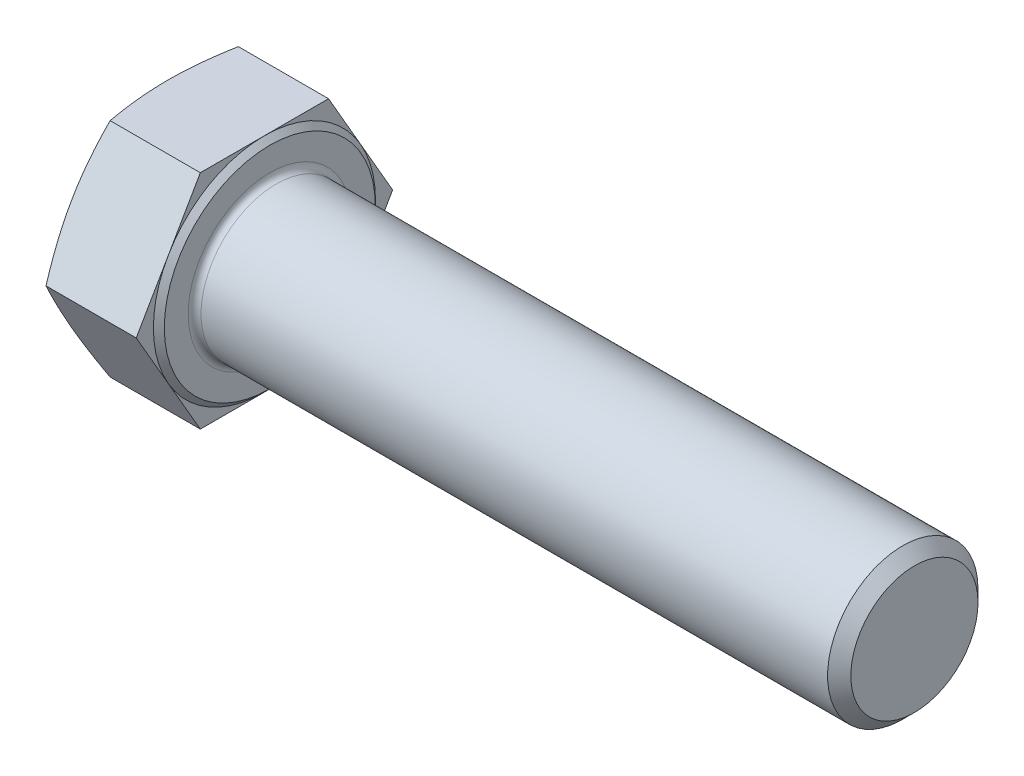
from build123d import *

# Parameters (mm, degrees)
BASEHEAD_DEPTH = 8.98
SKETCH3_R      = 7
BASEBODY_DEPTH = 60
HEADFILLET_R   = 0.6
CHAMFER1_SIZE  = 1.0825


with BuildPart() as part:
    # Sketch-BaseHead → BaseHead (new body)
    with BuildSketch(Plane(origin=(0, 0, 0), x_dir=(0, 0, -1), z_dir=(1, 0, 0))):
        Polygon((11.933830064, 0), (5.966915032, 10.335), (-5.966915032, 10.335), (-11.933830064, 0), (-5.966915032, -10.335), (5.966915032, -10.335), align=None)
    extrude(amount=BASEHEAD_DEPTH)

    # Sketch4 → HeadChamfer (revolve, cut)
    with BuildSketch(Plane(origin=(-0.264637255, 0, 5.916896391), x_dir=(0, 0, -1), z_dir=(0, 1, 0))):
        Polygon((17.850726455, -0.264637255), (16.251896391, -0.264637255), (17.850726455, -0.846563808), align=None)
    revolve(axis=Axis((-4.001564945, 0, 0), (1, 0, 0)), mode=Mode.SUBTRACT)

    # Sketch1 → Revolve1 (revolve)
    with BuildSketch(Plane.XY, mode=Mode.PRIVATE) as revolve1_sk:
        Polygon((8.98, 0), (9.48, 0), (9.48, -9.82), (8.98, -10.335), align=None)
    revolve(revolve1_sk.sketch.rotate(Axis((-4.001564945, 0, 0), (1, 0, 0)), 270), axis=Axis((-4.001564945, 0, 0), (1, 0, 0)))

    # Sketch3 → BaseBody (add)
    with BuildSketch(Plane(origin=(9.48, 0, 0), x_dir=(0, 0, -1), z_dir=(1, 0, 0))):
        Circle(SKETCH3_R)
    extrude(amount=BASEBODY_DEPTH)

    # HeadFillet
    headfillet_edges = [part.edges().sort_by_distance(p)[0] for p in [
        (9.48, 0, 7),
    ]]
    fillet(headfillet_edges, radius=HEADFILLET_R)

    # Chamfer1
    chamfer1_edges = [part.edges().sort_by_distance(p)[0] for p in [
        (69.48, 0, 7),
    ]]
    chamfer(chamfer1_edges, length=CHAMFER1_SIZE)


solid = part.part
